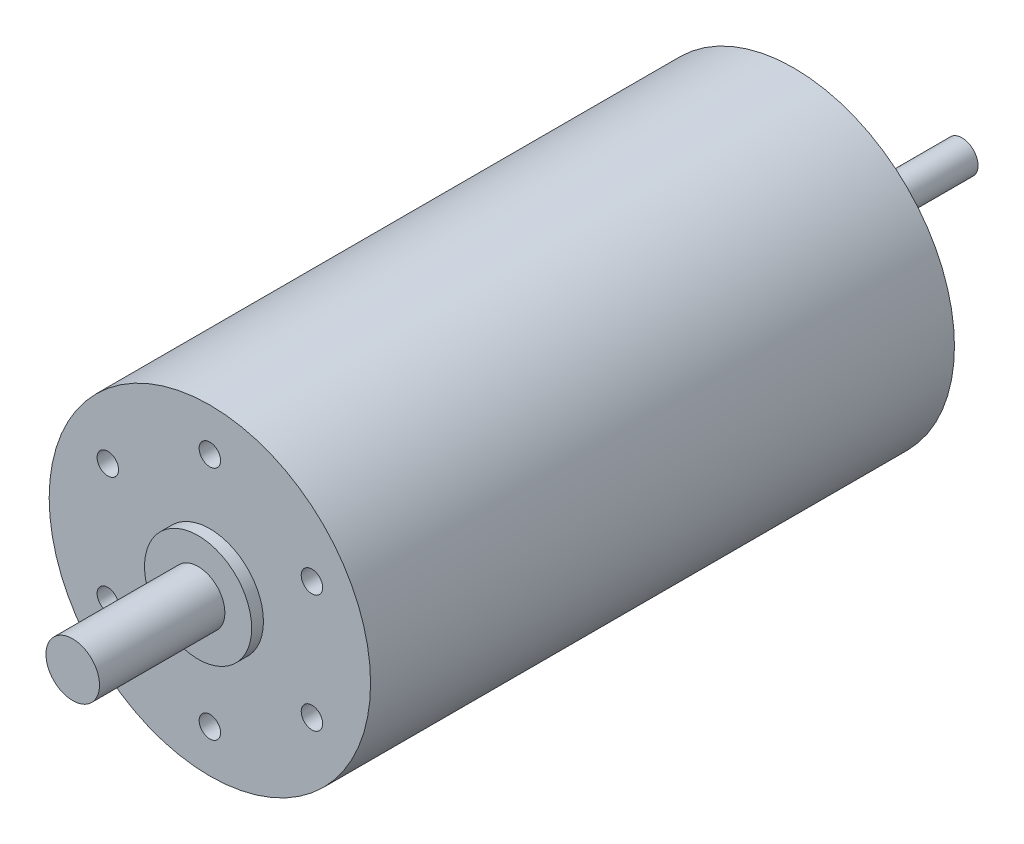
from build123d import *

# Parameters (mm, degrees)
SKETCH1_R          = 15
EXTRUDE1_DEPTH     = 54.5
SKETCH2_R          = 5
EXTRUDE2_DEPTH     = 1.1
SKETCH3_R          = 2.5
EXTRUDE3_DEPTH     = 12.8
SKETCH4_R          = 4
EXTRUDE4_DEPTH     = 1.35
SKETCH5_R          = 1.5
EXTRUDE5_DEPTH     = 15.7
SKETCH7_R          = 1
CUT_EXTRUDE1_DEPTH = 3
CIRPATTERN1_COUNT  = 6


with BuildPart() as part:
    # Sketch1 → Extrude1 (new body)
    with BuildSketch(Plane.XY):
        Circle(SKETCH1_R)
    extrude(amount=EXTRUDE1_DEPTH)

    # Sketch2 → Extrude2 (add)
    with BuildSketch(Plane.XY.offset(54.5)):
        Circle(SKETCH2_R)
    extrude(amount=EXTRUDE2_DEPTH)

    # Sketch3 → Extrude3 (add)
    with BuildSketch(Plane.XY.offset(54.5)):
        Circle(SKETCH3_R)
    extrude(amount=EXTRUDE3_DEPTH)

    # Sketch4 → Extrude4 (add)
    with BuildSketch(Plane(origin=(0, 0, 0), x_dir=(-1, 0, 0), z_dir=(0, 0, -1))):
        with Locations(Location((0, 0, 0), (0, 0, 180))):
            Circle(SKETCH4_R)
    extrude(amount=EXTRUDE4_DEPTH)

    # Sketch5 → Extrude5 (add)
    with BuildSketch(Plane(origin=(0, 0, 0), x_dir=(-1, 0, 0), z_dir=(0, 0, -1))):
        Circle(SKETCH5_R)
    extrude(amount=EXTRUDE5_DEPTH)

    # Sketch7 → Cut-Extrude1 (cut)
    with BuildSketch(Plane.XY.offset(54.5)):
        with Locations((0, -11)):
            Circle(SKETCH7_R)
    cut_extrude1 = extrude(amount=-CUT_EXTRUDE1_DEPTH, mode=Mode.SUBTRACT)

    # CirPattern1: Cut-Extrude1 ×6 about axis
    cirpattern1_axis = Axis((0, 0, 0), (0, 0, 1))
    for i in range(1, CIRPATTERN1_COUNT):
        add(cut_extrude1.rotate(cirpattern1_axis, i * 360 / CIRPATTERN1_COUNT), mode=Mode.SUBTRACT)


solid = part.part
